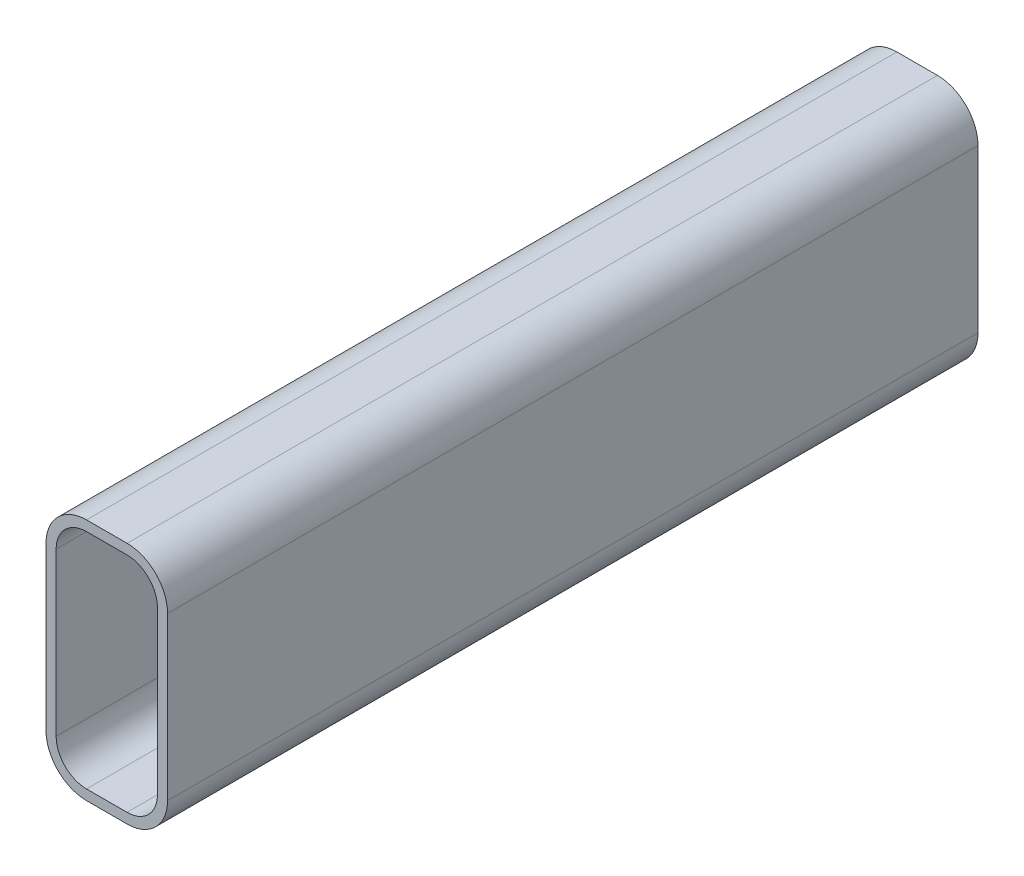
ISO-10303-21;
HEADER;
FILE_DESCRIPTION(('STEP AP214'),'2;1');
FILE_NAME('part.step','',(''),(''),'','','');
FILE_SCHEMA(('AUTOMOTIVE_DESIGN { 1 0 10303 214 1 1 1 1 }'));
ENDSEC;
DATA;
#1=APPLICATION_CONTEXT('core data for automotive mechanical design processes');
#2=APPLICATION_PROTOCOL_DEFINITION('international standard','automotive_design',2000,#1);
#3=PRODUCT_CONTEXT('',#1,'mechanical');
#4=PRODUCT('Part','Part','',(#3));
#5=PRODUCT_RELATED_PRODUCT_CATEGORY('part','',(#4));
#6=PRODUCT_DEFINITION_FORMATION('','',#4);
#7=PRODUCT_DEFINITION_CONTEXT('part definition',#1,'design');
#8=PRODUCT_DEFINITION('design','',#6,#7);
#9=PRODUCT_DEFINITION_SHAPE('','',#8);
#10=(LENGTH_UNIT() NAMED_UNIT(*) SI_UNIT(.MILLI.,.METRE.));
#11=(NAMED_UNIT(*) PLANE_ANGLE_UNIT() SI_UNIT($,.RADIAN.));
#12=(NAMED_UNIT(*) SI_UNIT($,.STERADIAN.) SOLID_ANGLE_UNIT());
#13=UNCERTAINTY_MEASURE_WITH_UNIT(LENGTH_MEASURE(1.E-05),#10,'distance_accuracy_value','');
#14=(GEOMETRIC_REPRESENTATION_CONTEXT(3) GLOBAL_UNCERTAINTY_ASSIGNED_CONTEXT((#13)) GLOBAL_UNIT_ASSIGNED_CONTEXT((#10,
#11,#12)) REPRESENTATION_CONTEXT('',''));
#15=CARTESIAN_POINT('',(0.,0.,0.));
#16=DIRECTION('',(0.,0.,1.));
#17=DIRECTION('',(1.,0.,0.));
#18=AXIS2_PLACEMENT_3D('',#15,#16,#17);
#19=CARTESIAN_POINT('',(6.35,25.4,254.));
#20=DIRECTION('',(0.,0.,1.));
#21=DIRECTION('',(1.,0.,0.));
#22=AXIS2_PLACEMENT_3D('',#19,#20,#21);
#23=PLANE('',#22);
#24=CARTESIAN_POINT('',(6.35,25.4,254.));
#25=DIRECTION('',(0.,0.,1.));
#26=DIRECTION('',(1.,0.,0.));
#27=AXIS2_PLACEMENT_3D('',#24,#25,#26);
#28=CIRCLE('',#27,12.7);
#29=CARTESIAN_POINT('',(19.05,25.4,254.));
#30=VERTEX_POINT('',#29);
#31=CARTESIAN_POINT('',(6.35,38.1,254.));
#32=VERTEX_POINT('',#31);
#33=EDGE_CURVE('E212',#30,#32,#28,.T.);
#34=ORIENTED_EDGE('',*,*,#33,.T.);
#35=DIRECTION('',(1.,0.,0.));
#36=VECTOR('',#35,1.);
#37=CARTESIAN_POINT('',(-6.34999999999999,38.1,254.));
#38=LINE('',#37,#36);
#39=CARTESIAN_POINT('',(-6.34999999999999,38.1,254.));
#40=VERTEX_POINT('',#39);
#41=EDGE_CURVE('E214',#40,#32,#38,.T.);
#42=ORIENTED_EDGE('',*,*,#41,.F.);
#43=CARTESIAN_POINT('',(-6.34999999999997,25.4,254.));
#44=DIRECTION('',(0.,0.,-1.));
#45=DIRECTION('',(-1.,0.,0.));
#46=AXIS2_PLACEMENT_3D('',#43,#44,#45);
#47=CIRCLE('',#46,12.7);
#48=CARTESIAN_POINT('',(-19.05,25.4,254.));
#49=VERTEX_POINT('',#48);
#50=EDGE_CURVE('E218',#49,#40,#47,.T.);
#51=ORIENTED_EDGE('',*,*,#50,.F.);
#52=DIRECTION('',(0.,-1.,0.));
#53=VECTOR('',#52,1.);
#54=CARTESIAN_POINT('',(-19.05,25.4,254.));
#55=LINE('',#54,#53);
#56=CARTESIAN_POINT('',(-19.05,-25.4,254.));
#57=VERTEX_POINT('',#56);
#58=EDGE_CURVE('E221',#49,#57,#55,.T.);
#59=ORIENTED_EDGE('',*,*,#58,.T.);
#60=CARTESIAN_POINT('',(-6.35,-25.4,254.));
#61=DIRECTION('',(0.,0.,-1.));
#62=DIRECTION('',(-1.,0.,0.));
#63=AXIS2_PLACEMENT_3D('',#60,#61,#62);
#64=CIRCLE('',#63,12.7);
#65=CARTESIAN_POINT('',(-6.35000000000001,-38.1,254.));
#66=VERTEX_POINT('',#65);
#67=EDGE_CURVE('E223',#66,#57,#64,.T.);
#68=ORIENTED_EDGE('',*,*,#67,.F.);
#69=DIRECTION('',(-1.,0.,0.));
#70=VECTOR('',#69,1.);
#71=CARTESIAN_POINT('',(6.34999999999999,-38.1,254.));
#72=LINE('',#71,#70);
#73=CARTESIAN_POINT('',(6.35,-38.1,254.));
#74=VERTEX_POINT('',#73);
#75=EDGE_CURVE('E226',#74,#66,#72,.T.);
#76=ORIENTED_EDGE('',*,*,#75,.F.);
#77=CARTESIAN_POINT('',(6.34999999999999,-25.4,254.));
#78=DIRECTION('',(0.,0.,-1.));
#79=DIRECTION('',(-1.,0.,0.));
#80=AXIS2_PLACEMENT_3D('',#77,#78,#79);
#81=CIRCLE('',#80,12.7);
#82=CARTESIAN_POINT('',(19.05,-25.4,254.));
#83=VERTEX_POINT('',#82);
#84=EDGE_CURVE('E229',#83,#74,#81,.T.);
#85=ORIENTED_EDGE('',*,*,#84,.F.);
#86=DIRECTION('',(0.,1.,0.));
#87=VECTOR('',#86,1.);
#88=CARTESIAN_POINT('',(19.05,-25.4,254.));
#89=LINE('',#88,#87);
#90=EDGE_CURVE('E232',#83,#30,#89,.T.);
#91=ORIENTED_EDGE('',*,*,#90,.T.);
#92=EDGE_LOOP('',(#34,#42,#51,#59,#68,#76,#85,#91));
#93=FACE_BOUND('',#92,.T.);
#94=DIRECTION('',(1.,0.,0.));
#95=VECTOR('',#94,1.);
#96=CARTESIAN_POINT('',(-6.34999999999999,34.925,254.));
#97=LINE('',#96,#95);
#98=CARTESIAN_POINT('',(-6.34999999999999,34.925,254.));
#99=VERTEX_POINT('',#98);
#100=CARTESIAN_POINT('',(6.35000000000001,34.925,254.));
#101=VERTEX_POINT('',#100);
#102=EDGE_CURVE('E152',#99,#101,#97,.T.);
#103=ORIENTED_EDGE('',*,*,#102,.T.);
#104=CARTESIAN_POINT('',(6.35,25.4,254.));
#105=DIRECTION('',(0.,0.,1.));
#106=DIRECTION('',(1.,0.,0.));
#107=AXIS2_PLACEMENT_3D('',#104,#105,#106);
#108=CIRCLE('',#107,9.525);
#109=CARTESIAN_POINT('',(15.875,25.4,254.));
#110=VERTEX_POINT('',#109);
#111=EDGE_CURVE('E143',#110,#101,#108,.T.);
#112=ORIENTED_EDGE('',*,*,#111,.F.);
#113=DIRECTION('',(0.,1.,0.));
#114=VECTOR('',#113,1.);
#115=CARTESIAN_POINT('',(15.875,-25.4,254.));
#116=LINE('',#115,#114);
#117=CARTESIAN_POINT('',(15.875,-25.4,254.));
#118=VERTEX_POINT('',#117);
#119=EDGE_CURVE('E179',#118,#110,#116,.T.);
#120=ORIENTED_EDGE('',*,*,#119,.F.);
#121=CARTESIAN_POINT('',(6.34999999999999,-25.4,254.));
#122=DIRECTION('',(0.,0.,1.));
#123=DIRECTION('',(1.,0.,0.));
#124=AXIS2_PLACEMENT_3D('',#121,#122,#123);
#125=CIRCLE('',#124,9.52499999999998);
#126=CARTESIAN_POINT('',(6.35,-34.925,254.));
#127=VERTEX_POINT('',#126);
#128=EDGE_CURVE('E47',#118,#127,#125,.F.);
#129=ORIENTED_EDGE('',*,*,#128,.T.);
#130=DIRECTION('',(-1.,0.,0.));
#131=VECTOR('',#130,1.);
#132=CARTESIAN_POINT('',(6.34999999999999,-34.925,254.));
#133=LINE('',#132,#131);
#134=CARTESIAN_POINT('',(-6.35000000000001,-34.925,254.));
#135=VERTEX_POINT('',#134);
#136=EDGE_CURVE('E175',#127,#135,#133,.T.);
#137=ORIENTED_EDGE('',*,*,#136,.T.);
#138=CARTESIAN_POINT('',(-6.35,-25.4,254.));
#139=DIRECTION('',(0.,0.,1.));
#140=DIRECTION('',(1.,0.,0.));
#141=AXIS2_PLACEMENT_3D('',#138,#139,#140);
#142=CIRCLE('',#141,9.52499999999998);
#143=CARTESIAN_POINT('',(-15.875,-25.4,254.));
#144=VERTEX_POINT('',#143);
#145=EDGE_CURVE('E172',#135,#144,#142,.F.);
#146=ORIENTED_EDGE('',*,*,#145,.T.);
#147=DIRECTION('',(0.,-1.,0.));
#148=VECTOR('',#147,1.);
#149=CARTESIAN_POINT('',(-15.875,25.4,254.));
#150=LINE('',#149,#148);
#151=CARTESIAN_POINT('',(-15.875,25.4,254.));
#152=VERTEX_POINT('',#151);
#153=EDGE_CURVE('E168',#152,#144,#150,.T.);
#154=ORIENTED_EDGE('',*,*,#153,.F.);
#155=CARTESIAN_POINT('',(-6.34999999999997,25.4,254.));
#156=DIRECTION('',(0.,0.,1.));
#157=DIRECTION('',(1.,0.,0.));
#158=AXIS2_PLACEMENT_3D('',#155,#156,#157);
#159=CIRCLE('',#158,9.52499999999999);
#160=EDGE_CURVE('E166',#152,#99,#159,.F.);
#161=ORIENTED_EDGE('',*,*,#160,.T.);
#162=EDGE_LOOP('',(#103,#112,#120,#129,#137,#146,#154,#161));
#163=FACE_BOUND('',#162,.T.);
#164=ADVANCED_FACE('F32',(#93,#163),#23,.T.);
#165=CARTESIAN_POINT('',(6.35,25.4,0.));
#166=DIRECTION('',(0.,0.,1.));
#167=DIRECTION('',(1.,0.,0.));
#168=AXIS2_PLACEMENT_3D('',#165,#166,#167);
#169=PLANE('',#168);
#170=CARTESIAN_POINT('',(6.35,25.4,0.));
#171=DIRECTION('',(0.,0.,1.));
#172=DIRECTION('',(1.,0.,0.));
#173=AXIS2_PLACEMENT_3D('',#170,#171,#172);
#174=CIRCLE('',#173,12.7);
#175=CARTESIAN_POINT('',(19.05,25.4,0.));
#176=VERTEX_POINT('',#175);
#177=CARTESIAN_POINT('',(6.35,38.1,0.));
#178=VERTEX_POINT('',#177);
#179=EDGE_CURVE('E161',#176,#178,#174,.T.);
#180=ORIENTED_EDGE('',*,*,#179,.F.);
#181=DIRECTION('',(0.,1.,0.));
#182=VECTOR('',#181,1.);
#183=CARTESIAN_POINT('',(19.05,-25.4,0.));
#184=LINE('',#183,#182);
#185=CARTESIAN_POINT('',(19.05,-25.4,0.));
#186=VERTEX_POINT('',#185);
#187=EDGE_CURVE('E215',#186,#176,#184,.T.);
#188=ORIENTED_EDGE('',*,*,#187,.F.);
#189=CARTESIAN_POINT('',(6.34999999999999,-25.4,0.));
#190=DIRECTION('',(0.,0.,-1.));
#191=DIRECTION('',(-1.,0.,0.));
#192=AXIS2_PLACEMENT_3D('',#189,#190,#191);
#193=CIRCLE('',#192,12.7);
#194=CARTESIAN_POINT('',(6.35,-38.1,0.));
#195=VERTEX_POINT('',#194);
#196=EDGE_CURVE('E252',#186,#195,#193,.T.);
#197=ORIENTED_EDGE('',*,*,#196,.T.);
#198=DIRECTION('',(-1.,0.,0.));
#199=VECTOR('',#198,1.);
#200=CARTESIAN_POINT('',(6.34999999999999,-38.1,0.));
#201=LINE('',#200,#199);
#202=CARTESIAN_POINT('',(-6.35000000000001,-38.1,0.));
#203=VERTEX_POINT('',#202);
#204=EDGE_CURVE('E249',#195,#203,#201,.T.);
#205=ORIENTED_EDGE('',*,*,#204,.T.);
#206=CARTESIAN_POINT('',(-6.35,-25.4,0.));
#207=DIRECTION('',(0.,0.,-1.));
#208=DIRECTION('',(-1.,0.,0.));
#209=AXIS2_PLACEMENT_3D('',#206,#207,#208);
#210=CIRCLE('',#209,12.7);
#211=CARTESIAN_POINT('',(-19.05,-25.4,0.));
#212=VERTEX_POINT('',#211);
#213=EDGE_CURVE('E246',#203,#212,#210,.T.);
#214=ORIENTED_EDGE('',*,*,#213,.T.);
#215=DIRECTION('',(0.,-1.,0.));
#216=VECTOR('',#215,1.);
#217=CARTESIAN_POINT('',(-19.05,25.4,0.));
#218=LINE('',#217,#216);
#219=CARTESIAN_POINT('',(-19.05,25.4,0.));
#220=VERTEX_POINT('',#219);
#221=EDGE_CURVE('E243',#220,#212,#218,.T.);
#222=ORIENTED_EDGE('',*,*,#221,.F.);
#223=CARTESIAN_POINT('',(-6.34999999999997,25.4,0.));
#224=DIRECTION('',(0.,0.,-1.));
#225=DIRECTION('',(-1.,0.,0.));
#226=AXIS2_PLACEMENT_3D('',#223,#224,#225);
#227=CIRCLE('',#226,12.7);
#228=CARTESIAN_POINT('',(-6.34999999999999,38.1,0.));
#229=VERTEX_POINT('',#228);
#230=EDGE_CURVE('E240',#220,#229,#227,.T.);
#231=ORIENTED_EDGE('',*,*,#230,.T.);
#232=DIRECTION('',(1.,0.,0.));
#233=VECTOR('',#232,1.);
#234=CARTESIAN_POINT('',(-6.34999999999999,38.1,0.));
#235=LINE('',#234,#233);
#236=EDGE_CURVE('E237',#229,#178,#235,.T.);
#237=ORIENTED_EDGE('',*,*,#236,.T.);
#238=EDGE_LOOP('',(#180,#188,#197,#205,#214,#222,#231,#237));
#239=FACE_BOUND('',#238,.T.);
#240=CARTESIAN_POINT('',(6.35,25.4,0.));
#241=DIRECTION('',(0.,0.,1.));
#242=DIRECTION('',(1.,0.,0.));
#243=AXIS2_PLACEMENT_3D('',#240,#241,#242);
#244=CIRCLE('',#243,9.525);
#245=CARTESIAN_POINT('',(15.875,25.4,0.));
#246=VERTEX_POINT('',#245);
#247=CARTESIAN_POINT('',(6.35000000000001,34.925,0.));
#248=VERTEX_POINT('',#247);
#249=EDGE_CURVE('E55',#246,#248,#244,.T.);
#250=ORIENTED_EDGE('',*,*,#249,.T.);
#251=DIRECTION('',(1.,0.,0.));
#252=VECTOR('',#251,1.);
#253=CARTESIAN_POINT('',(-6.34999999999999,34.925,0.));
#254=LINE('',#253,#252);
#255=CARTESIAN_POINT('',(-6.34999999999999,34.925,0.));
#256=VERTEX_POINT('',#255);
#257=EDGE_CURVE('E160',#256,#248,#254,.T.);
#258=ORIENTED_EDGE('',*,*,#257,.F.);
#259=CARTESIAN_POINT('',(-6.34999999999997,25.4,0.));
#260=DIRECTION('',(0.,0.,1.));
#261=DIRECTION('',(1.,0.,0.));
#262=AXIS2_PLACEMENT_3D('',#259,#260,#261);
#263=CIRCLE('',#262,9.52499999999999);
#264=CARTESIAN_POINT('',(-15.875,25.4,0.));
#265=VERTEX_POINT('',#264);
#266=EDGE_CURVE('E183',#265,#256,#263,.F.);
#267=ORIENTED_EDGE('',*,*,#266,.F.);
#268=DIRECTION('',(0.,-1.,0.));
#269=VECTOR('',#268,1.);
#270=CARTESIAN_POINT('',(-15.875,25.4,0.));
#271=LINE('',#270,#269);
#272=CARTESIAN_POINT('',(-15.875,-25.4,0.));
#273=VERTEX_POINT('',#272);
#274=EDGE_CURVE('E186',#265,#273,#271,.T.);
#275=ORIENTED_EDGE('',*,*,#274,.T.);
#276=CARTESIAN_POINT('',(-6.35,-25.4,0.));
#277=DIRECTION('',(0.,0.,1.));
#278=DIRECTION('',(1.,0.,0.));
#279=AXIS2_PLACEMENT_3D('',#276,#277,#278);
#280=CIRCLE('',#279,9.52499999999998);
#281=CARTESIAN_POINT('',(-6.35000000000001,-34.925,0.));
#282=VERTEX_POINT('',#281);
#283=EDGE_CURVE('E189',#282,#273,#280,.F.);
#284=ORIENTED_EDGE('',*,*,#283,.F.);
#285=DIRECTION('',(-1.,0.,0.));
#286=VECTOR('',#285,1.);
#287=CARTESIAN_POINT('',(6.34999999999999,-34.925,0.));
#288=LINE('',#287,#286);
#289=CARTESIAN_POINT('',(6.35,-34.925,0.));
#290=VERTEX_POINT('',#289);
#291=EDGE_CURVE('E192',#290,#282,#288,.T.);
#292=ORIENTED_EDGE('',*,*,#291,.F.);
#293=CARTESIAN_POINT('',(6.34999999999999,-25.4,0.));
#294=DIRECTION('',(0.,0.,1.));
#295=DIRECTION('',(1.,0.,0.));
#296=AXIS2_PLACEMENT_3D('',#293,#294,#295);
#297=CIRCLE('',#296,9.52499999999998);
#298=CARTESIAN_POINT('',(15.875,-25.4,0.));
#299=VERTEX_POINT('',#298);
#300=EDGE_CURVE('E195',#299,#290,#297,.F.);
#301=ORIENTED_EDGE('',*,*,#300,.F.);
#302=DIRECTION('',(0.,1.,0.));
#303=VECTOR('',#302,1.);
#304=CARTESIAN_POINT('',(15.875,-25.4,0.));
#305=LINE('',#304,#303);
#306=EDGE_CURVE('E153',#299,#246,#305,.T.);
#307=ORIENTED_EDGE('',*,*,#306,.T.);
#308=EDGE_LOOP('',(#250,#258,#267,#275,#284,#292,#301,#307));
#309=FACE_BOUND('',#308,.T.);
#310=ADVANCED_FACE('F279',(#239,#309),#169,.F.);
#311=CARTESIAN_POINT('',(6.35,25.4,254.));
#312=DIRECTION('',(0.,0.,-1.));
#313=DIRECTION('',(-1.,0.,0.));
#314=AXIS2_PLACEMENT_3D('',#311,#312,#313);
#315=CYLINDRICAL_SURFACE('',#314,12.7);
#316=ORIENTED_EDGE('',*,*,#179,.T.);
#317=DIRECTION('',(0.,0.,-1.));
#318=VECTOR('',#317,1.);
#319=CARTESIAN_POINT('',(6.35,38.1,254.));
#320=LINE('',#319,#318);
#321=EDGE_CURVE('E11',#32,#178,#320,.T.);
#322=ORIENTED_EDGE('',*,*,#321,.F.);
#323=ORIENTED_EDGE('',*,*,#33,.F.);
#324=DIRECTION('',(0.,0.,-1.));
#325=VECTOR('',#324,1.);
#326=CARTESIAN_POINT('',(19.05,25.4,254.));
#327=LINE('',#326,#325);
#328=EDGE_CURVE('E234',#30,#176,#327,.T.);
#329=ORIENTED_EDGE('',*,*,#328,.T.);
#330=EDGE_LOOP('',(#316,#322,#323,#329));
#331=FACE_BOUND('',#330,.T.);
#332=ADVANCED_FACE('F34',(#331),#315,.T.);
#333=CARTESIAN_POINT('',(-6.34999999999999,38.1,254.));
#334=DIRECTION('',(0.,1.,0.));
#335=DIRECTION('',(-1.,0.,0.));
#336=AXIS2_PLACEMENT_3D('',#333,#334,#335);
#337=PLANE('',#336);
#338=ORIENTED_EDGE('',*,*,#236,.F.);
#339=DIRECTION('',(0.,0.,-1.));
#340=VECTOR('',#339,1.);
#341=CARTESIAN_POINT('',(-6.34999999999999,38.1,254.));
#342=LINE('',#341,#340);
#343=EDGE_CURVE('E40',#40,#229,#342,.T.);
#344=ORIENTED_EDGE('',*,*,#343,.F.);
#345=ORIENTED_EDGE('',*,*,#41,.T.);
#346=ORIENTED_EDGE('',*,*,#321,.T.);
#347=EDGE_LOOP('',(#338,#344,#345,#346));
#348=FACE_BOUND('',#347,.T.);
#349=ADVANCED_FACE('F274',(#348),#337,.T.);
#350=CARTESIAN_POINT('',(-6.34999999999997,25.4,254.));
#351=DIRECTION('',(0.,0.,-1.));
#352=DIRECTION('',(-1.,0.,0.));
#353=AXIS2_PLACEMENT_3D('',#350,#351,#352);
#354=CYLINDRICAL_SURFACE('',#353,12.7);
#355=ORIENTED_EDGE('',*,*,#230,.F.);
#356=DIRECTION('',(0.,0.,-1.));
#357=VECTOR('',#356,1.);
#358=CARTESIAN_POINT('',(-19.05,25.4,254.));
#359=LINE('',#358,#357);
#360=EDGE_CURVE('E266',#49,#220,#359,.T.);
#361=ORIENTED_EDGE('',*,*,#360,.F.);
#362=ORIENTED_EDGE('',*,*,#50,.T.);
#363=ORIENTED_EDGE('',*,*,#343,.T.);
#364=EDGE_LOOP('',(#355,#361,#362,#363));
#365=FACE_BOUND('',#364,.T.);
#366=ADVANCED_FACE('F270',(#365),#354,.T.);
#367=CARTESIAN_POINT('',(-19.05,25.4,254.));
#368=DIRECTION('',(1.,0.,0.));
#369=DIRECTION('',(0.,1.,0.));
#370=AXIS2_PLACEMENT_3D('',#367,#368,#369);
#371=PLANE('',#370);
#372=ORIENTED_EDGE('',*,*,#221,.T.);
#373=DIRECTION('',(0.,0.,-1.));
#374=VECTOR('',#373,1.);
#375=CARTESIAN_POINT('',(-19.05,-25.4,254.));
#376=LINE('',#375,#374);
#377=EDGE_CURVE('E264',#57,#212,#376,.T.);
#378=ORIENTED_EDGE('',*,*,#377,.F.);
#379=ORIENTED_EDGE('',*,*,#58,.F.);
#380=ORIENTED_EDGE('',*,*,#360,.T.);
#381=EDGE_LOOP('',(#372,#378,#379,#380));
#382=FACE_BOUND('',#381,.T.);
#383=ADVANCED_FACE('F284',(#382),#371,.F.);
#384=CARTESIAN_POINT('',(-6.35,-25.4,254.));
#385=DIRECTION('',(0.,0.,-1.));
#386=DIRECTION('',(-1.,0.,0.));
#387=AXIS2_PLACEMENT_3D('',#384,#385,#386);
#388=CYLINDRICAL_SURFACE('',#387,12.7);
#389=ORIENTED_EDGE('',*,*,#213,.F.);
#390=DIRECTION('',(0.,0.,-1.));
#391=VECTOR('',#390,1.);
#392=CARTESIAN_POINT('',(-6.35000000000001,-38.1,254.));
#393=LINE('',#392,#391);
#394=EDGE_CURVE('E262',#66,#203,#393,.T.);
#395=ORIENTED_EDGE('',*,*,#394,.F.);
#396=ORIENTED_EDGE('',*,*,#67,.T.);
#397=ORIENTED_EDGE('',*,*,#377,.T.);
#398=EDGE_LOOP('',(#389,#395,#396,#397));
#399=FACE_BOUND('',#398,.T.);
#400=ADVANCED_FACE('F303',(#399),#388,.T.);
#401=CARTESIAN_POINT('',(6.34999999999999,-38.1,254.));
#402=DIRECTION('',(0.,-1.,0.));
#403=DIRECTION('',(1.,0.,0.));
#404=AXIS2_PLACEMENT_3D('',#401,#402,#403);
#405=PLANE('',#404);
#406=ORIENTED_EDGE('',*,*,#204,.F.);
#407=DIRECTION('',(0.,0.,-1.));
#408=VECTOR('',#407,1.);
#409=CARTESIAN_POINT('',(6.35,-38.1,254.));
#410=LINE('',#409,#408);
#411=EDGE_CURVE('E260',#74,#195,#410,.T.);
#412=ORIENTED_EDGE('',*,*,#411,.F.);
#413=ORIENTED_EDGE('',*,*,#75,.T.);
#414=ORIENTED_EDGE('',*,*,#394,.T.);
#415=EDGE_LOOP('',(#406,#412,#413,#414));
#416=FACE_BOUND('',#415,.T.);
#417=ADVANCED_FACE('F301',(#416),#405,.T.);
#418=CARTESIAN_POINT('',(6.34999999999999,-25.4,254.));
#419=DIRECTION('',(0.,0.,-1.));
#420=DIRECTION('',(-1.,0.,0.));
#421=AXIS2_PLACEMENT_3D('',#418,#419,#420);
#422=CYLINDRICAL_SURFACE('',#421,12.7);
#423=ORIENTED_EDGE('',*,*,#196,.F.);
#424=DIRECTION('',(0.,0.,-1.));
#425=VECTOR('',#424,1.);
#426=CARTESIAN_POINT('',(19.05,-25.4,254.));
#427=LINE('',#426,#425);
#428=EDGE_CURVE('E258',#83,#186,#427,.T.);
#429=ORIENTED_EDGE('',*,*,#428,.F.);
#430=ORIENTED_EDGE('',*,*,#84,.T.);
#431=ORIENTED_EDGE('',*,*,#411,.T.);
#432=EDGE_LOOP('',(#423,#429,#430,#431));
#433=FACE_BOUND('',#432,.T.);
#434=ADVANCED_FACE('F297',(#433),#422,.T.);
#435=CARTESIAN_POINT('',(19.05,-25.4,254.));
#436=DIRECTION('',(-1.,0.,0.));
#437=DIRECTION('',(0.,-1.,0.));
#438=AXIS2_PLACEMENT_3D('',#435,#436,#437);
#439=PLANE('',#438);
#440=ORIENTED_EDGE('',*,*,#187,.T.);
#441=ORIENTED_EDGE('',*,*,#328,.F.);
#442=ORIENTED_EDGE('',*,*,#90,.F.);
#443=ORIENTED_EDGE('',*,*,#428,.T.);
#444=EDGE_LOOP('',(#440,#441,#442,#443));
#445=FACE_BOUND('',#444,.T.);
#446=ADVANCED_FACE('F321',(#445),#439,.F.);
#447=CARTESIAN_POINT('',(6.35,25.4,254.));
#448=DIRECTION('',(0.,0.,-1.));
#449=DIRECTION('',(-1.,0.,0.));
#450=AXIS2_PLACEMENT_3D('',#447,#448,#449);
#451=CYLINDRICAL_SURFACE('',#450,9.525);
#452=ORIENTED_EDGE('',*,*,#249,.F.);
#453=DIRECTION('',(0.,0.,-1.));
#454=VECTOR('',#453,1.);
#455=CARTESIAN_POINT('',(15.875,25.4,254.));
#456=LINE('',#455,#454);
#457=EDGE_CURVE('E148',#110,#246,#456,.T.);
#458=ORIENTED_EDGE('',*,*,#457,.F.);
#459=ORIENTED_EDGE('',*,*,#111,.T.);
#460=DIRECTION('',(0.,0.,-1.));
#461=VECTOR('',#460,1.);
#462=CARTESIAN_POINT('',(6.35000000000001,34.925,254.));
#463=LINE('',#462,#461);
#464=EDGE_CURVE('E146',#101,#248,#463,.T.);
#465=ORIENTED_EDGE('',*,*,#464,.T.);
#466=EDGE_LOOP('',(#452,#458,#459,#465));
#467=FACE_BOUND('',#466,.T.);
#468=ADVANCED_FACE('F145',(#467),#451,.F.);
#469=CARTESIAN_POINT('',(-6.34999999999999,34.925,254.));
#470=DIRECTION('',(0.,1.,0.));
#471=DIRECTION('',(-1.,0.,0.));
#472=AXIS2_PLACEMENT_3D('',#469,#470,#471);
#473=PLANE('',#472);
#474=ORIENTED_EDGE('',*,*,#257,.T.);
#475=ORIENTED_EDGE('',*,*,#464,.F.);
#476=ORIENTED_EDGE('',*,*,#102,.F.);
#477=DIRECTION('',(0.,0.,-1.));
#478=VECTOR('',#477,1.);
#479=CARTESIAN_POINT('',(-6.34999999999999,34.925,254.));
#480=LINE('',#479,#478);
#481=EDGE_CURVE('E162',#99,#256,#480,.T.);
#482=ORIENTED_EDGE('',*,*,#481,.T.);
#483=EDGE_LOOP('',(#474,#475,#476,#482));
#484=FACE_BOUND('',#483,.T.);
#485=ADVANCED_FACE('F157',(#484),#473,.F.);
#486=CARTESIAN_POINT('',(-6.34999999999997,25.4,254.));
#487=DIRECTION('',(0.,0.,-1.));
#488=DIRECTION('',(-1.,0.,0.));
#489=AXIS2_PLACEMENT_3D('',#486,#487,#488);
#490=CYLINDRICAL_SURFACE('',#489,9.52499999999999);
#491=ORIENTED_EDGE('',*,*,#266,.T.);
#492=ORIENTED_EDGE('',*,*,#481,.F.);
#493=ORIENTED_EDGE('',*,*,#160,.F.);
#494=DIRECTION('',(0.,0.,-1.));
#495=VECTOR('',#494,1.);
#496=CARTESIAN_POINT('',(-15.875,25.4,254.));
#497=LINE('',#496,#495);
#498=EDGE_CURVE('E209',#152,#265,#497,.T.);
#499=ORIENTED_EDGE('',*,*,#498,.T.);
#500=EDGE_LOOP('',(#491,#492,#493,#499));
#501=FACE_BOUND('',#500,.T.);
#502=ADVANCED_FACE('F344',(#501),#490,.F.);
#503=CARTESIAN_POINT('',(-15.875,25.4,254.));
#504=DIRECTION('',(1.,0.,0.));
#505=DIRECTION('',(0.,1.,0.));
#506=AXIS2_PLACEMENT_3D('',#503,#504,#505);
#507=PLANE('',#506);
#508=ORIENTED_EDGE('',*,*,#274,.F.);
#509=ORIENTED_EDGE('',*,*,#498,.F.);
#510=ORIENTED_EDGE('',*,*,#153,.T.);
#511=DIRECTION('',(0.,0.,-1.));
#512=VECTOR('',#511,1.);
#513=CARTESIAN_POINT('',(-15.875,-25.4,254.));
#514=LINE('',#513,#512);
#515=EDGE_CURVE('E207',#144,#273,#514,.T.);
#516=ORIENTED_EDGE('',*,*,#515,.T.);
#517=EDGE_LOOP('',(#508,#509,#510,#516));
#518=FACE_BOUND('',#517,.T.);
#519=ADVANCED_FACE('F350',(#518),#507,.T.);
#520=CARTESIAN_POINT('',(-6.35,-25.4,254.));
#521=DIRECTION('',(0.,0.,-1.));
#522=DIRECTION('',(-1.,0.,0.));
#523=AXIS2_PLACEMENT_3D('',#520,#521,#522);
#524=CYLINDRICAL_SURFACE('',#523,9.52499999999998);
#525=ORIENTED_EDGE('',*,*,#283,.T.);
#526=ORIENTED_EDGE('',*,*,#515,.F.);
#527=ORIENTED_EDGE('',*,*,#145,.F.);
#528=DIRECTION('',(0.,0.,-1.));
#529=VECTOR('',#528,1.);
#530=CARTESIAN_POINT('',(-6.35000000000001,-34.925,254.));
#531=LINE('',#530,#529);
#532=EDGE_CURVE('E205',#135,#282,#531,.T.);
#533=ORIENTED_EDGE('',*,*,#532,.T.);
#534=EDGE_LOOP('',(#525,#526,#527,#533));
#535=FACE_BOUND('',#534,.T.);
#536=ADVANCED_FACE('F358',(#535),#524,.F.);
#537=CARTESIAN_POINT('',(6.34999999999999,-34.925,254.));
#538=DIRECTION('',(0.,-1.,0.));
#539=DIRECTION('',(1.,0.,0.));
#540=AXIS2_PLACEMENT_3D('',#537,#538,#539);
#541=PLANE('',#540);
#542=ORIENTED_EDGE('',*,*,#291,.T.);
#543=ORIENTED_EDGE('',*,*,#532,.F.);
#544=ORIENTED_EDGE('',*,*,#136,.F.);
#545=DIRECTION('',(0.,0.,-1.));
#546=VECTOR('',#545,1.);
#547=CARTESIAN_POINT('',(6.35,-34.925,254.));
#548=LINE('',#547,#546);
#549=EDGE_CURVE('E203',#127,#290,#548,.T.);
#550=ORIENTED_EDGE('',*,*,#549,.T.);
#551=EDGE_LOOP('',(#542,#543,#544,#550));
#552=FACE_BOUND('',#551,.T.);
#553=ADVANCED_FACE('F366',(#552),#541,.F.);
#554=CARTESIAN_POINT('',(6.34999999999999,-25.4,254.));
#555=DIRECTION('',(0.,0.,-1.));
#556=DIRECTION('',(-1.,0.,0.));
#557=AXIS2_PLACEMENT_3D('',#554,#555,#556);
#558=CYLINDRICAL_SURFACE('',#557,9.52499999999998);
#559=ORIENTED_EDGE('',*,*,#300,.T.);
#560=ORIENTED_EDGE('',*,*,#549,.F.);
#561=ORIENTED_EDGE('',*,*,#128,.F.);
#562=DIRECTION('',(0.,0.,-1.));
#563=VECTOR('',#562,1.);
#564=CARTESIAN_POINT('',(15.875,-25.4,254.));
#565=LINE('',#564,#563);
#566=EDGE_CURVE('E201',#118,#299,#565,.T.);
#567=ORIENTED_EDGE('',*,*,#566,.T.);
#568=EDGE_LOOP('',(#559,#560,#561,#567));
#569=FACE_BOUND('',#568,.T.);
#570=ADVANCED_FACE('F374',(#569),#558,.F.);
#571=CARTESIAN_POINT('',(15.875,-25.4,254.));
#572=DIRECTION('',(-1.,0.,0.));
#573=DIRECTION('',(0.,-1.,0.));
#574=AXIS2_PLACEMENT_3D('',#571,#572,#573);
#575=PLANE('',#574);
#576=ORIENTED_EDGE('',*,*,#306,.F.);
#577=ORIENTED_EDGE('',*,*,#566,.F.);
#578=ORIENTED_EDGE('',*,*,#119,.T.);
#579=ORIENTED_EDGE('',*,*,#457,.T.);
#580=EDGE_LOOP('',(#576,#577,#578,#579));
#581=FACE_BOUND('',#580,.T.);
#582=ADVANCED_FACE('F382',(#581),#575,.T.);
#583=CLOSED_SHELL('',(#164,#310,#332,#349,#366,#383,#400,#417,#434,#446,#468,#485,#502,#519,
#536,#553,#570,#582));
#584=MANIFOLD_SOLID_BREP('B2',#583);
#585=ADVANCED_BREP_SHAPE_REPRESENTATION('',(#18,#584),#14);
#586=SHAPE_DEFINITION_REPRESENTATION(#9,#585);
ENDSEC;
END-ISO-10303-21;
